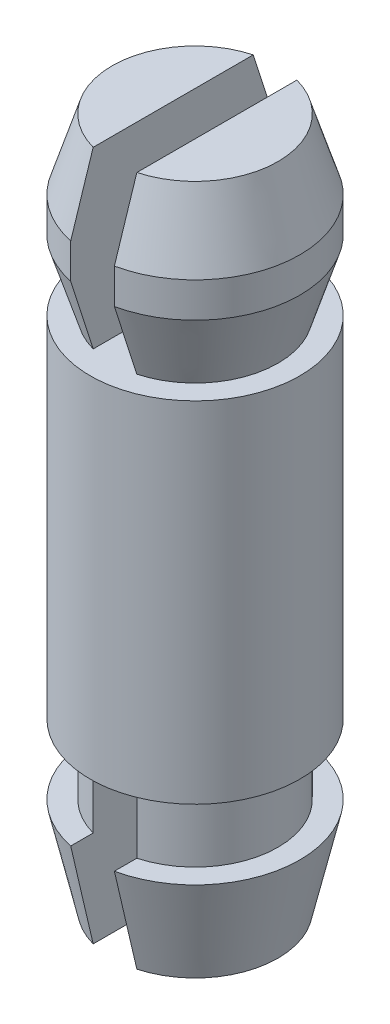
ISO-10303-21;
HEADER;
FILE_DESCRIPTION(('STEP AP214'),'2;1');
FILE_NAME('part.step','',(''),(''),'','','');
FILE_SCHEMA(('AUTOMOTIVE_DESIGN { 1 0 10303 214 1 1 1 1 }'));
ENDSEC;
DATA;
#1=APPLICATION_CONTEXT('core data for automotive mechanical design processes');
#2=APPLICATION_PROTOCOL_DEFINITION('international standard','automotive_design',2000,#1);
#3=PRODUCT_CONTEXT('',#1,'mechanical');
#4=PRODUCT('Part','Part','',(#3));
#5=PRODUCT_RELATED_PRODUCT_CATEGORY('part','',(#4));
#6=PRODUCT_DEFINITION_FORMATION('','',#4);
#7=PRODUCT_DEFINITION_CONTEXT('part definition',#1,'design');
#8=PRODUCT_DEFINITION('design','',#6,#7);
#9=PRODUCT_DEFINITION_SHAPE('','',#8);
#10=(LENGTH_UNIT() NAMED_UNIT(*) SI_UNIT(.MILLI.,.METRE.));
#11=(NAMED_UNIT(*) PLANE_ANGLE_UNIT() SI_UNIT($,.RADIAN.));
#12=(NAMED_UNIT(*) SI_UNIT($,.STERADIAN.) SOLID_ANGLE_UNIT());
#13=UNCERTAINTY_MEASURE_WITH_UNIT(LENGTH_MEASURE(1.E-05),#10,'distance_accuracy_value','');
#14=(GEOMETRIC_REPRESENTATION_CONTEXT(3) GLOBAL_UNCERTAINTY_ASSIGNED_CONTEXT((#13)) GLOBAL_UNIT_ASSIGNED_CONTEXT((#10,
#11,#12)) REPRESENTATION_CONTEXT('',''));
#15=CARTESIAN_POINT('',(0.,0.,0.));
#16=DIRECTION('',(0.,0.,1.));
#17=DIRECTION('',(1.,0.,0.));
#18=AXIS2_PLACEMENT_3D('',#15,#16,#17);
#19=CARTESIAN_POINT('',(0.,-3.8,0.));
#20=DIRECTION('',(0.,-1.,0.));
#21=DIRECTION('',(0.,0.,-1.));
#22=AXIS2_PLACEMENT_3D('',#19,#20,#21);
#23=PLANE('',#22);
#24=DIRECTION('',(0.,0.,1.));
#25=VECTOR('',#24,1.);
#26=CARTESIAN_POINT('',(-0.499999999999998,-3.8,-2.4));
#27=LINE('',#26,#25);
#28=CARTESIAN_POINT('',(-0.499999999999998,-3.8,-1.83303027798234));
#29=VERTEX_POINT('',#28);
#30=CARTESIAN_POINT('',(-0.499999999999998,-3.8,1.83303027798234));
#31=VERTEX_POINT('',#30);
#32=EDGE_CURVE('E272',#29,#31,#27,.T.);
#33=ORIENTED_EDGE('',*,*,#32,.T.);
#34=CARTESIAN_POINT('',(0.,-3.8,0.));
#35=DIRECTION('',(0.,-1.,0.));
#36=DIRECTION('',(0.,0.,-1.));
#37=AXIS2_PLACEMENT_3D('',#34,#35,#36);
#38=CIRCLE('',#37,1.9);
#39=EDGE_CURVE('E185',#31,#29,#38,.T.);
#40=ORIENTED_EDGE('',*,*,#39,.T.);
#41=EDGE_LOOP('',(#33,#40));
#42=FACE_BOUND('',#41,.T.);
#43=ADVANCED_FACE('F33',(#42),#23,.T.);
#44=CARTESIAN_POINT('',(0.,-3.8,0.));
#45=DIRECTION('',(0.,1.,0.));
#46=DIRECTION('',(0.,0.,1.));
#47=AXIS2_PLACEMENT_3D('',#44,#45,#46);
#48=CONICAL_SURFACE('',#47,1.9,0.223476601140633);
#49=CARTESIAN_POINT('',(-0.499999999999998,-6.49752165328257,-1.18582496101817));
#50=CARTESIAN_POINT('',(-0.499999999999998,-6.3270478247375,-1.2278632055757));
#51=CARTESIAN_POINT('',(-0.499999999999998,-6.15650043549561,-1.26960134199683));
#52=CARTESIAN_POINT('',(-0.499999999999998,-5.81529012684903,-1.35260079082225));
#53=CARTESIAN_POINT('',(-0.499999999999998,-5.64462720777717,-1.39386210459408));
#54=CARTESIAN_POINT('',(-0.499999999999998,-5.13251332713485,-1.51711571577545));
#55=CARTESIAN_POINT('',(-0.499999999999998,-4.79093499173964,-1.59857823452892));
#56=CARTESIAN_POINT('',(-0.499999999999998,-4.06171036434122,-1.77149560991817));
#57=CARTESIAN_POINT('',(-0.499999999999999,-3.67403418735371,-1.86282413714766));
#58=CARTESIAN_POINT('',(-0.499999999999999,-2.75052311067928,-2.07947896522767));
#59=CARTESIAN_POINT('',(-0.499999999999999,-2.21461146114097,-2.20447780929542));
#60=CARTESIAN_POINT('',(-0.499999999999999,-1.14259889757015,-2.45366261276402));
#61=CARTESIAN_POINT('',(-0.499999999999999,-0.606497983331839,-2.57784857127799));
#62=CARTESIAN_POINT('',(-0.499999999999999,0.785594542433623,-2.8996102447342));
#63=CARTESIAN_POINT('',(-0.499999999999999,1.64167926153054,-3.09678298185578));
#64=CARTESIAN_POINT('',(-0.499999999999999,3.35401578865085,-3.49040239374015));
#65=CARTESIAN_POINT('',(-0.499999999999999,4.21026759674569,-3.68684906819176));
#66=CARTESIAN_POINT('',(-0.499999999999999,5.92286668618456,-4.07929135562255));
#67=CARTESIAN_POINT('',(-0.5,6.77921396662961,-4.27528697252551));
#68=CARTESIAN_POINT('',(-0.5,8.49197804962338,-4.66697064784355));
#69=CARTESIAN_POINT('',(-0.5,9.34839485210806,-4.86265870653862));
#70=CARTESIAN_POINT('',(-0.5,10.2048304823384,-5.05826405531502));
#71=B_SPLINE_CURVE_WITH_KNOTS('',3,(#49,#50,#51,#52,#53,#54,#55,#56,#57,#58,#59,#60,#61,#62,#63,
#64,#65,#66,#67,#68,#69,#70),.UNSPECIFIED.,.F.,.F.,(4,2,2,2,2,2,2,2,2,2,4),(0.,
0.526740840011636,1.0534801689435,2.10695187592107,3.30181638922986,4.95270406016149,
6.60359353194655,9.23908579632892,11.874579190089,14.5100495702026,17.1455175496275),.UNSPECIFIED.);
#72=CARTESIAN_POINT('',(-0.499999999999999,-1.6,-2.3473389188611));
#73=VERTEX_POINT('',#72);
#74=EDGE_CURVE('E322',#29,#73,#71,.T.);
#75=ORIENTED_EDGE('',*,*,#74,.F.);
#76=ORIENTED_EDGE('',*,*,#39,.F.);
#77=CARTESIAN_POINT('',(-0.499999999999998,-6.49752165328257,1.18582496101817));
#78=CARTESIAN_POINT('',(-0.499999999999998,-6.3270478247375,1.2278632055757));
#79=CARTESIAN_POINT('',(-0.499999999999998,-6.15650043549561,1.26960134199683));
#80=CARTESIAN_POINT('',(-0.499999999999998,-5.81529012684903,1.35260079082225));
#81=CARTESIAN_POINT('',(-0.499999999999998,-5.64462720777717,1.39386210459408));
#82=CARTESIAN_POINT('',(-0.499999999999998,-5.13251332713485,1.51711571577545));
#83=CARTESIAN_POINT('',(-0.499999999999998,-4.79093499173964,1.59857823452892));
#84=CARTESIAN_POINT('',(-0.499999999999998,-4.06171036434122,1.77149560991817));
#85=CARTESIAN_POINT('',(-0.499999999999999,-3.67403418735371,1.86282413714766));
#86=CARTESIAN_POINT('',(-0.499999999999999,-2.75052311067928,2.07947896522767));
#87=CARTESIAN_POINT('',(-0.499999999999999,-2.21461146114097,2.20447780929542));
#88=CARTESIAN_POINT('',(-0.499999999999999,-1.14259889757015,2.45366261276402));
#89=CARTESIAN_POINT('',(-0.499999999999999,-0.606497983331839,2.57784857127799));
#90=CARTESIAN_POINT('',(-0.499999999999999,0.785594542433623,2.8996102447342));
#91=CARTESIAN_POINT('',(-0.499999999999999,1.64167926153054,3.09678298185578));
#92=CARTESIAN_POINT('',(-0.499999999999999,3.35401578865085,3.49040239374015));
#93=CARTESIAN_POINT('',(-0.499999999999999,4.21026759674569,3.68684906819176));
#94=CARTESIAN_POINT('',(-0.499999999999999,5.92286668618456,4.07929135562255));
#95=CARTESIAN_POINT('',(-0.5,6.77921396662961,4.27528697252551));
#96=CARTESIAN_POINT('',(-0.5,8.49197804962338,4.66697064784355));
#97=CARTESIAN_POINT('',(-0.5,9.34839485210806,4.86265870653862));
#98=CARTESIAN_POINT('',(-0.5,10.2048304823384,5.05826405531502));
#99=B_SPLINE_CURVE_WITH_KNOTS('',3,(#77,#78,#79,#80,#81,#82,#83,#84,#85,#86,#87,#88,#89,#90,#91,
#92,#93,#94,#95,#96,#97,#98),.UNSPECIFIED.,.F.,.F.,(4,2,2,2,2,2,2,2,2,2,4),(0.,
0.526740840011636,1.0534801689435,2.10695187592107,3.30181638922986,4.95270406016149,
6.60359353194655,9.23908579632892,11.874579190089,14.5100495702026,17.1455175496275),.UNSPECIFIED.);
#100=CARTESIAN_POINT('',(-0.499999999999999,-1.6,2.3473389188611));
#101=VERTEX_POINT('',#100);
#102=EDGE_CURVE('E155',#101,#31,#99,.F.);
#103=ORIENTED_EDGE('',*,*,#102,.F.);
#104=CARTESIAN_POINT('',(0.,-1.6,0.));
#105=DIRECTION('',(0.,-1.,0.));
#106=DIRECTION('',(0.,0.,-1.));
#107=AXIS2_PLACEMENT_3D('',#104,#105,#106);
#108=CIRCLE('',#107,2.4);
#109=EDGE_CURVE('E179',#101,#73,#108,.T.);
#110=ORIENTED_EDGE('',*,*,#109,.T.);
#111=EDGE_LOOP('',(#75,#76,#103,#110));
#112=FACE_BOUND('',#111,.T.);
#113=ADVANCED_FACE('F247',(#112),#48,.T.);
#114=CARTESIAN_POINT('',(2.4,-1.6,0.));
#115=DIRECTION('',(0.,1.,0.));
#116=DIRECTION('',(0.,0.,1.));
#117=AXIS2_PLACEMENT_3D('',#114,#115,#116);
#118=PLANE('',#117);
#119=DIRECTION('',(0.,0.,1.));
#120=VECTOR('',#119,1.);
#121=CARTESIAN_POINT('',(-0.499999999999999,-1.6,0.));
#122=LINE('',#121,#120);
#123=CARTESIAN_POINT('',(-0.499999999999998,-1.6,-1.83303027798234));
#124=VERTEX_POINT('',#123);
#125=EDGE_CURVE('E150',#73,#124,#122,.T.);
#126=ORIENTED_EDGE('',*,*,#125,.F.);
#127=ORIENTED_EDGE('',*,*,#109,.F.);
#128=CARTESIAN_POINT('',(-0.499999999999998,-1.6,1.83303027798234));
#129=VERTEX_POINT('',#128);
#130=EDGE_CURVE('E282',#129,#101,#122,.T.);
#131=ORIENTED_EDGE('',*,*,#130,.F.);
#132=CARTESIAN_POINT('',(0.,-1.6,0.));
#133=DIRECTION('',(0.,-1.,0.));
#134=DIRECTION('',(0.,0.,-1.));
#135=AXIS2_PLACEMENT_3D('',#132,#133,#134);
#136=CIRCLE('',#135,1.9);
#137=EDGE_CURVE('E170',#129,#124,#136,.T.);
#138=ORIENTED_EDGE('',*,*,#137,.T.);
#139=EDGE_LOOP('',(#126,#127,#131,#138));
#140=FACE_BOUND('',#139,.T.);
#141=ADVANCED_FACE('F252',(#140),#118,.T.);
#142=CARTESIAN_POINT('',(0.,-3.8,0.));
#143=DIRECTION('',(0.,-1.,0.));
#144=DIRECTION('',(0.,0.,-1.));
#145=AXIS2_PLACEMENT_3D('',#142,#143,#144);
#146=CYLINDRICAL_SURFACE('',#145,1.9);
#147=DIRECTION('',(0.,-1.,0.));
#148=VECTOR('',#147,1.);
#149=CARTESIAN_POINT('',(-0.499999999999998,-3.8,-1.83303027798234));
#150=LINE('',#149,#148);
#151=CARTESIAN_POINT('',(-0.499999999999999,0.,-1.83303027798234));
#152=VERTEX_POINT('',#151);
#153=EDGE_CURVE('E144',#124,#152,#150,.F.);
#154=ORIENTED_EDGE('',*,*,#153,.F.);
#155=ORIENTED_EDGE('',*,*,#137,.F.);
#156=DIRECTION('',(0.,-1.,0.));
#157=VECTOR('',#156,1.);
#158=CARTESIAN_POINT('',(-0.499999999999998,-3.8,1.83303027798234));
#159=LINE('',#158,#157);
#160=CARTESIAN_POINT('',(-0.499999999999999,0.,1.83303027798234));
#161=VERTEX_POINT('',#160);
#162=EDGE_CURVE('E165',#161,#129,#159,.T.);
#163=ORIENTED_EDGE('',*,*,#162,.F.);
#164=CARTESIAN_POINT('',(0.,0.,0.));
#165=DIRECTION('',(0.,-1.,0.));
#166=DIRECTION('',(0.,0.,-1.));
#167=AXIS2_PLACEMENT_3D('',#164,#165,#166);
#168=CIRCLE('',#167,1.9);
#169=EDGE_CURVE('E161',#161,#152,#168,.T.);
#170=ORIENTED_EDGE('',*,*,#169,.T.);
#171=EDGE_LOOP('',(#154,#155,#163,#170));
#172=FACE_BOUND('',#171,.T.);
#173=ADVANCED_FACE('F164',(#172),#146,.T.);
#174=CARTESIAN_POINT('',(0.,8.,0.));
#175=DIRECTION('',(0.,1.,0.));
#176=DIRECTION('',(0.,0.,1.));
#177=AXIS2_PLACEMENT_3D('',#174,#175,#176);
#178=CONICAL_SURFACE('',#177,1.9,0.302884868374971);
#179=CARTESIAN_POINT('',(-0.499999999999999,5.41360855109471,-0.970527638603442));
#180=CARTESIAN_POINT('',(-0.5,5.54585791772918,-1.01698560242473));
#181=CARTESIAN_POINT('',(-0.5,5.67830320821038,-1.06287926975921));
#182=CARTESIAN_POINT('',(-0.5,5.94348659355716,-1.15380666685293));
#183=CARTESIAN_POINT('',(-0.5,6.07622468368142,-1.19884041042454));
#184=CARTESIAN_POINT('',(-0.5,6.34189411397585,-1.28831648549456));
#185=CARTESIAN_POINT('',(-0.5,6.47482544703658,-1.33275883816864));
#186=CARTESIAN_POINT('',(-0.5,6.74083665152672,-1.42119853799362));
#187=CARTESIAN_POINT('',(-0.5,6.87391652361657,-1.4651958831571));
#188=CARTESIAN_POINT('',(-0.5,7.23102104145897,-1.58275854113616));
#189=CARTESIAN_POINT('',(-0.5,7.45514673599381,-1.65601670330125));
#190=CARTESIAN_POINT('',(-0.5,7.90360722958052,-1.80190125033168));
#191=CARTESIAN_POINT('',(-0.5,8.12794203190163,-1.87452762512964));
#192=CARTESIAN_POINT('',(-0.5,8.59793854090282,-2.02616777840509));
#193=CARTESIAN_POINT('',(-0.5,8.8436144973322,-2.10513736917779));
#194=CARTESIAN_POINT('',(-0.5,9.33508844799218,-2.26269607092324));
#195=CARTESIAN_POINT('',(-0.5,9.58088644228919,-2.3412851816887));
#196=CARTESIAN_POINT('',(-0.5,10.0725608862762,-2.49817982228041));
#197=CARTESIAN_POINT('',(-0.5,10.3184373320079,-2.57648536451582));
#198=CARTESIAN_POINT('',(-0.5,10.8102587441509,-2.7328796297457));
#199=CARTESIAN_POINT('',(-0.5,11.0562037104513,-2.81096835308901));
#200=CARTESIAN_POINT('',(-0.5,11.3021729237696,-2.88898042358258));
#201=B_SPLINE_CURVE_WITH_KNOTS('',3,(#179,#180,#181,#182,#183,#184,#185,#186,#187,#188,#189,
#190,#191,#192,#193,#194,#195,#196,#197,#198,#199,#200),.UNSPECIFIED.,.F.,.F.,(4,2,2,2,2,2,2,2,
2,2,4),(0.,0.420512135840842,0.841017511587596,1.26150778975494,1.68199994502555,
2.38938211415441,3.09677553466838,3.87094291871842,4.64511072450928,5.41924423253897,
6.19337649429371),.UNSPECIFIED.);
#202=CARTESIAN_POINT('',(-0.5,8.,-1.83303027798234));
#203=VERTEX_POINT('',#202);
#204=CARTESIAN_POINT('',(-0.499999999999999,9.6,-2.3473389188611));
#205=VERTEX_POINT('',#204);
#206=EDGE_CURVE('E209',#203,#205,#201,.T.);
#207=ORIENTED_EDGE('',*,*,#206,.F.);
#208=CARTESIAN_POINT('',(0.,8.,0.));
#209=DIRECTION('',(0.,-1.,0.));
#210=DIRECTION('',(0.,0.,-1.));
#211=AXIS2_PLACEMENT_3D('',#208,#209,#210);
#212=CIRCLE('',#211,1.9);
#213=CARTESIAN_POINT('',(-0.5,8.,1.83303027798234));
#214=VERTEX_POINT('',#213);
#215=EDGE_CURVE('E224',#214,#203,#212,.T.);
#216=ORIENTED_EDGE('',*,*,#215,.F.);
#217=CARTESIAN_POINT('',(-0.5,11.3021729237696,2.88898042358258));
#218=CARTESIAN_POINT('',(-0.5,10.8102265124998,2.73291329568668));
#219=CARTESIAN_POINT('',(-0.5,10.3183553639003,2.57660611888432));
#220=CARTESIAN_POINT('',(-0.5,9.58083707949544,2.34127312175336));
#221=CARTESIAN_POINT('',(-0.5,9.33505020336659,2.26268485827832));
#222=CARTESIAN_POINT('',(-0.5,8.84359639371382,2.10513051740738));
#223=CARTESIAN_POINT('',(-0.5,8.5979294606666,2.02616443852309));
#224=CARTESIAN_POINT('',(-0.5,8.10675653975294,1.86769272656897));
#225=CARTESIAN_POINT('',(-0.5,7.86125056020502,1.78818706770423));
#226=CARTESIAN_POINT('',(-0.5,7.37049472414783,1.62839503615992));
#227=CARTESIAN_POINT('',(-0.5,7.12524486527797,1.54810867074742));
#228=CARTESIAN_POINT('',(-0.5,6.75766981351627,1.42675226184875));
#229=CARTESIAN_POINT('',(-0.5,6.6351920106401,1.38614472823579));
#230=CARTESIAN_POINT('',(-0.5,6.39037170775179,1.30452529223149));
#231=CARTESIAN_POINT('',(-0.5,6.26802920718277,1.26351339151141));
#232=CARTESIAN_POINT('',(-0.5,6.02351794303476,1.1809607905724));
#233=CARTESIAN_POINT('',(-0.5,5.90134918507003,1.13942007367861));
#234=CARTESIAN_POINT('',(-0.5,5.65726702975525,1.05559016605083));
#235=CARTESIAN_POINT('',(-0.5,5.53535363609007,1.01330096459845));
#236=CARTESIAN_POINT('',(-0.499999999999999,5.41360855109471,0.970527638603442));
#237=B_SPLINE_CURVE_WITH_KNOTS('',3,(#217,#218,#219,#220,#221,#222,#223,#224,#225,#226,#227,
#228,#229,#230,#231,#232,#233,#234,#235,#236),.UNSPECIFIED.,.F.,.F.,(4,2,2,2,2,2,2,2,2,4),(0.,
1.54832710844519,2.32246243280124,3.09660080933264,3.87077645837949,4.64494490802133,
5.03204648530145,5.41914646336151,5.80625867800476,6.19337644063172),.UNSPECIFIED.);
#238=CARTESIAN_POINT('',(-0.499999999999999,9.6,2.3473389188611));
#239=VERTEX_POINT('',#238);
#240=EDGE_CURVE('E373',#239,#214,#237,.T.);
#241=ORIENTED_EDGE('',*,*,#240,.F.);
#242=CARTESIAN_POINT('',(0.,9.6,0.));
#243=DIRECTION('',(0.,-1.,0.));
#244=DIRECTION('',(0.,0.,-1.));
#245=AXIS2_PLACEMENT_3D('',#242,#243,#244);
#246=CIRCLE('',#245,2.4);
#247=EDGE_CURVE('E218',#239,#205,#246,.T.);
#248=ORIENTED_EDGE('',*,*,#247,.T.);
#249=EDGE_LOOP('',(#207,#216,#241,#248));
#250=FACE_BOUND('',#249,.T.);
#251=ADVANCED_FACE('F242',(#250),#178,.T.);
#252=CARTESIAN_POINT('',(0.,-3.8,0.));
#253=DIRECTION('',(0.,-1.,0.));
#254=DIRECTION('',(0.,0.,-1.));
#255=AXIS2_PLACEMENT_3D('',#252,#253,#254);
#256=CYLINDRICAL_SURFACE('',#255,2.4);
#257=DIRECTION('',(0.,-1.,0.));
#258=VECTOR('',#257,1.);
#259=CARTESIAN_POINT('',(0.499999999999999,-3.8,2.3473389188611));
#260=LINE('',#259,#258);
#261=CARTESIAN_POINT('',(0.499999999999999,9.6,2.3473389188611));
#262=VERTEX_POINT('',#261);
#263=CARTESIAN_POINT('',(0.5,10.4,2.3473389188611));
#264=VERTEX_POINT('',#263);
#265=EDGE_CURVE('E339',#262,#264,#260,.F.);
#266=ORIENTED_EDGE('',*,*,#265,.F.);
#267=CARTESIAN_POINT('',(0.499999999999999,9.6,-2.3473389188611));
#268=VERTEX_POINT('',#267);
#269=EDGE_CURVE('E221',#268,#262,#246,.T.);
#270=ORIENTED_EDGE('',*,*,#269,.F.);
#271=DIRECTION('',(0.,-1.,0.));
#272=VECTOR('',#271,1.);
#273=CARTESIAN_POINT('',(0.499999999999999,-3.8,-2.3473389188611));
#274=LINE('',#273,#272);
#275=CARTESIAN_POINT('',(0.5,10.4,-2.3473389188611));
#276=VERTEX_POINT('',#275);
#277=EDGE_CURVE('E199',#276,#268,#274,.T.);
#278=ORIENTED_EDGE('',*,*,#277,.F.);
#279=CARTESIAN_POINT('',(0.,10.4,0.));
#280=DIRECTION('',(0.,-1.,0.));
#281=DIRECTION('',(0.,0.,-1.));
#282=AXIS2_PLACEMENT_3D('',#279,#280,#281);
#283=CIRCLE('',#282,2.4);
#284=EDGE_CURVE('E198',#276,#264,#283,.T.);
#285=ORIENTED_EDGE('',*,*,#284,.T.);
#286=EDGE_LOOP('',(#266,#270,#278,#285));
#287=FACE_BOUND('',#286,.T.);
#288=ADVANCED_FACE('F402',(#287),#256,.T.);
#289=CARTESIAN_POINT('',(0.,10.4,0.));
#290=DIRECTION('',(0.,-1.,0.));
#291=DIRECTION('',(0.,0.,-1.));
#292=AXIS2_PLACEMENT_3D('',#289,#290,#291);
#293=CONICAL_SURFACE('',#292,2.4,0.302884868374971);
#294=CARTESIAN_POINT('',(-0.5,7.6398215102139,-3.22401460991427));
#295=CARTESIAN_POINT('',(-0.5,8.18731851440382,-3.05083408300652));
#296=CARTESIAN_POINT('',(-0.5,8.73474800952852,-2.87743814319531));
#297=CARTESIAN_POINT('',(-0.5,9.55563881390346,-2.61656864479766));
#298=CARTESIAN_POINT('',(-0.5,9.82922375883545,-2.52948386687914));
#299=CARTESIAN_POINT('',(-0.5,10.3762875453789,-2.35497919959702));
#300=CARTESIAN_POINT('',(-0.5,10.6497663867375,-2.26755930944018));
#301=CARTESIAN_POINT('',(-0.5,11.1965802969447,-2.09224321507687));
#302=CARTESIAN_POINT('',(-0.5,11.46991536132,-2.00434699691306));
#303=CARTESIAN_POINT('',(-0.5,12.0163621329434,-1.82786691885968));
#304=CARTESIAN_POINT('',(-0.5,12.2894738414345,-1.73928306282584));
#305=CARTESIAN_POINT('',(-0.5,12.6988811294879,-1.60559713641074));
#306=CARTESIAN_POINT('',(-0.5,12.8353087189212,-1.56089951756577));
#307=CARTESIAN_POINT('',(-0.5,13.1080478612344,-1.47115261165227));
#308=CARTESIAN_POINT('',(-0.5,13.2443594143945,-1.42610332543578));
#309=CARTESIAN_POINT('',(-0.5,13.5168337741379,-1.33554758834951));
#310=CARTESIAN_POINT('',(-0.5,13.6529965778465,-1.29004112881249));
#311=CARTESIAN_POINT('',(-0.5,13.9251076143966,-1.19838786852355));
#312=CARTESIAN_POINT('',(-0.5,14.061055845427,-1.15224106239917));
#313=CARTESIAN_POINT('',(-0.5,14.1968640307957,-1.10568245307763));
#314=B_SPLINE_CURVE_WITH_KNOTS('',3,(#294,#295,#296,#297,#298,#299,#300,#301,#302,#303,#304,
#305,#306,#307,#308,#309,#310,#311,#312,#313),.UNSPECIFIED.,.F.,.F.,(4,2,2,2,2,2,2,2,2,4),(0.,
1.72270206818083,2.58403367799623,3.44536732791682,4.30672635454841,5.16808055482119,
5.59876948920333,6.02945738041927,6.46015345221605,6.8908531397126),.UNSPECIFIED.);
#315=CARTESIAN_POINT('',(-0.5,10.4,-2.3473389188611));
#316=VERTEX_POINT('',#315);
#317=CARTESIAN_POINT('',(-0.5,12.,-1.83303027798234));
#318=VERTEX_POINT('',#317);
#319=EDGE_CURVE('E378',#316,#318,#314,.T.);
#320=ORIENTED_EDGE('',*,*,#319,.F.);
#321=CARTESIAN_POINT('',(-0.5,10.4,2.3473389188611));
#322=VERTEX_POINT('',#321);
#323=EDGE_CURVE('E203',#322,#316,#283,.T.);
#324=ORIENTED_EDGE('',*,*,#323,.F.);
#325=CARTESIAN_POINT('',(-0.5,14.1968640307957,1.10568245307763));
#326=CARTESIAN_POINT('',(-0.500000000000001,14.0494896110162,1.15620163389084));
#327=CARTESIAN_POINT('',(-0.5,13.9019523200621,1.20624141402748));
#328=CARTESIAN_POINT('',(-0.5,13.6066318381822,1.3055860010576));
#329=CARTESIAN_POINT('',(-0.5,13.4588486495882,1.35489081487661));
#330=CARTESIAN_POINT('',(-0.5,13.1631166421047,1.45298917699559));
#331=CARTESIAN_POINT('',(-0.5,13.0151678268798,1.50178273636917));
#332=CARTESIAN_POINT('',(-0.5,12.719142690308,1.59898268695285));
#333=CARTESIAN_POINT('',(-0.5,12.571066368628,1.64738907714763));
#334=CARTESIAN_POINT('',(-0.5,12.1731952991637,1.77701784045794));
#335=CARTESIAN_POINT('',(-0.5,11.9233125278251,1.85796990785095));
#336=CARTESIAN_POINT('',(-0.5,11.4233636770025,2.01931352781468));
#337=CARTESIAN_POINT('',(-0.5,11.1732975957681,2.09970507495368));
#338=CARTESIAN_POINT('',(-0.5,10.3763527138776,2.35522584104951));
#339=CARTESIAN_POINT('',(-0.5,9.8292388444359,2.5296216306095));
#340=CARTESIAN_POINT('',(-0.5,9.00834677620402,2.79049171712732));
#341=CARTESIAN_POINT('',(-0.5,8.7346828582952,2.87732666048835));
#342=CARTESIAN_POINT('',(-0.5,8.18729415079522,3.0508035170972));
#343=CARTESIAN_POINT('',(-0.5,7.9135693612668,3.13744543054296));
#344=CARTESIAN_POINT('',(-0.5,7.6398215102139,3.22401460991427));
#345=B_SPLINE_CURVE_WITH_KNOTS('',3,(#325,#326,#327,#328,#329,#330,#331,#332,#333,#334,#335,
#336,#337,#338,#339,#340,#341,#342,#343,#344),.UNSPECIFIED.,.F.,.F.,(4,2,2,2,2,2,2,2,2,4),(0.,
0.467375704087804,0.93474700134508,1.40210815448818,1.86947053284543,2.65747433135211,
3.4454857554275,5.16819270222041,6.02952321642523,6.89085284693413),.UNSPECIFIED.);
#346=CARTESIAN_POINT('',(-0.5,12.,1.83303027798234));
#347=VERTEX_POINT('',#346);
#348=EDGE_CURVE('E363',#347,#322,#345,.T.);
#349=ORIENTED_EDGE('',*,*,#348,.F.);
#350=CARTESIAN_POINT('',(0.,12.,0.));
#351=DIRECTION('',(0.,-1.,0.));
#352=DIRECTION('',(0.,0.,-1.));
#353=AXIS2_PLACEMENT_3D('',#350,#351,#352);
#354=CIRCLE('',#353,1.9);
#355=EDGE_CURVE('E204',#347,#318,#354,.T.);
#356=ORIENTED_EDGE('',*,*,#355,.T.);
#357=EDGE_LOOP('',(#320,#324,#349,#356));
#358=FACE_BOUND('',#357,.T.);
#359=ADVANCED_FACE('F265',(#358),#293,.T.);
#360=CARTESIAN_POINT('',(1.9,12.,0.));
#361=DIRECTION('',(0.,1.,0.));
#362=DIRECTION('',(0.,0.,1.));
#363=AXIS2_PLACEMENT_3D('',#360,#361,#362);
#364=PLANE('',#363);
#365=DIRECTION('',(0.,0.,1.));
#366=VECTOR('',#365,1.);
#367=CARTESIAN_POINT('',(-0.5,12.,0.));
#368=LINE('',#367,#366);
#369=EDGE_CURVE('E11',#318,#347,#368,.T.);
#370=ORIENTED_EDGE('',*,*,#369,.F.);
#371=ORIENTED_EDGE('',*,*,#355,.F.);
#372=EDGE_LOOP('',(#370,#371));
#373=FACE_BOUND('',#372,.T.);
#374=ADVANCED_FACE('F257',(#373),#364,.T.);
#375=DIRECTION('',(0.,0.,1.));
#376=VECTOR('',#375,1.);
#377=CARTESIAN_POINT('',(0.499999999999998,-3.8,-2.4));
#378=LINE('',#377,#376);
#379=CARTESIAN_POINT('',(0.499999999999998,-3.8,-1.83303027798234));
#380=VERTEX_POINT('',#379);
#381=CARTESIAN_POINT('',(0.499999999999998,-3.8,1.83303027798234));
#382=VERTEX_POINT('',#381);
#383=EDGE_CURVE('E269',#380,#382,#378,.T.);
#384=ORIENTED_EDGE('',*,*,#383,.F.);
#385=EDGE_CURVE('E183',#380,#382,#38,.T.);
#386=ORIENTED_EDGE('',*,*,#385,.T.);
#387=EDGE_LOOP('',(#384,#386));
#388=FACE_BOUND('',#387,.T.);
#389=ADVANCED_FACE('F35',(#388),#23,.T.);
#390=CARTESIAN_POINT('',(0.499999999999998,-6.49752165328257,-1.18582496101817));
#391=CARTESIAN_POINT('',(0.499999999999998,-6.3270478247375,-1.2278632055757));
#392=CARTESIAN_POINT('',(0.499999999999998,-6.15650043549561,-1.26960134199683));
#393=CARTESIAN_POINT('',(0.499999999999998,-5.81529012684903,-1.35260079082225));
#394=CARTESIAN_POINT('',(0.499999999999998,-5.64462720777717,-1.39386210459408));
#395=CARTESIAN_POINT('',(0.499999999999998,-5.13251332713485,-1.51711571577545));
#396=CARTESIAN_POINT('',(0.499999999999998,-4.79093499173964,-1.59857823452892));
#397=CARTESIAN_POINT('',(0.499999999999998,-4.06171036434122,-1.77149560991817));
#398=CARTESIAN_POINT('',(0.499999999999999,-3.67403418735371,-1.86282413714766));
#399=CARTESIAN_POINT('',(0.499999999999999,-2.75052311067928,-2.07947896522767));
#400=CARTESIAN_POINT('',(0.499999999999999,-2.21461146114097,-2.20447780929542));
#401=CARTESIAN_POINT('',(0.499999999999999,-1.14259889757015,-2.45366261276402));
#402=CARTESIAN_POINT('',(0.499999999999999,-0.606497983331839,-2.57784857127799));
#403=CARTESIAN_POINT('',(0.499999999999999,0.785594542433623,-2.8996102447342));
#404=CARTESIAN_POINT('',(0.499999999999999,1.64167926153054,-3.09678298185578));
#405=CARTESIAN_POINT('',(0.499999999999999,3.35401578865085,-3.49040239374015));
#406=CARTESIAN_POINT('',(0.499999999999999,4.21026759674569,-3.68684906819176));
#407=CARTESIAN_POINT('',(0.499999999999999,5.92286668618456,-4.07929135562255));
#408=CARTESIAN_POINT('',(0.5,6.77921396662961,-4.27528697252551));
#409=CARTESIAN_POINT('',(0.5,8.49197804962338,-4.66697064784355));
#410=CARTESIAN_POINT('',(0.5,9.34839485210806,-4.86265870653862));
#411=CARTESIAN_POINT('',(0.5,10.2048304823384,-5.05826405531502));
#412=B_SPLINE_CURVE_WITH_KNOTS('',3,(#390,#391,#392,#393,#394,#395,#396,#397,#398,#399,#400,
#401,#402,#403,#404,#405,#406,#407,#408,#409,#410,#411),.UNSPECIFIED.,.F.,.F.,(4,2,2,2,2,2,2,2,
2,2,4),(0.,0.526740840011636,1.0534801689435,2.10695187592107,3.30181638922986,4.95270406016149,
6.60359353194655,9.23908579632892,11.874579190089,14.5100495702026,17.1455175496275),.UNSPECIFIED.);
#413=CARTESIAN_POINT('',(0.499999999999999,-1.6,-2.3473389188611));
#414=VERTEX_POINT('',#413);
#415=EDGE_CURVE('E276',#414,#380,#412,.F.);
#416=ORIENTED_EDGE('',*,*,#415,.F.);
#417=CARTESIAN_POINT('',(0.499999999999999,-1.6,2.3473389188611));
#418=VERTEX_POINT('',#417);
#419=EDGE_CURVE('E182',#414,#418,#108,.T.);
#420=ORIENTED_EDGE('',*,*,#419,.T.);
#421=CARTESIAN_POINT('',(0.499999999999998,-6.49752165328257,1.18582496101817));
#422=CARTESIAN_POINT('',(0.499999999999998,-6.3270478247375,1.2278632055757));
#423=CARTESIAN_POINT('',(0.499999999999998,-6.15650043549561,1.26960134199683));
#424=CARTESIAN_POINT('',(0.499999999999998,-5.81529012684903,1.35260079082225));
#425=CARTESIAN_POINT('',(0.499999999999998,-5.64462720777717,1.39386210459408));
#426=CARTESIAN_POINT('',(0.499999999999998,-5.13251332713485,1.51711571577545));
#427=CARTESIAN_POINT('',(0.499999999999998,-4.79093499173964,1.59857823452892));
#428=CARTESIAN_POINT('',(0.499999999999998,-4.06171036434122,1.77149560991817));
#429=CARTESIAN_POINT('',(0.499999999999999,-3.67403418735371,1.86282413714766));
#430=CARTESIAN_POINT('',(0.499999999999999,-2.75052311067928,2.07947896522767));
#431=CARTESIAN_POINT('',(0.499999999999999,-2.21461146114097,2.20447780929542));
#432=CARTESIAN_POINT('',(0.499999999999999,-1.14259889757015,2.45366261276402));
#433=CARTESIAN_POINT('',(0.499999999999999,-0.606497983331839,2.57784857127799));
#434=CARTESIAN_POINT('',(0.499999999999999,0.785594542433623,2.8996102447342));
#435=CARTESIAN_POINT('',(0.499999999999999,1.64167926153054,3.09678298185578));
#436=CARTESIAN_POINT('',(0.499999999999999,3.35401578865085,3.49040239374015));
#437=CARTESIAN_POINT('',(0.499999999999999,4.21026759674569,3.68684906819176));
#438=CARTESIAN_POINT('',(0.499999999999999,5.92286668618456,4.07929135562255));
#439=CARTESIAN_POINT('',(0.5,6.77921396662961,4.27528697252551));
#440=CARTESIAN_POINT('',(0.5,8.49197804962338,4.66697064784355));
#441=CARTESIAN_POINT('',(0.5,9.34839485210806,4.86265870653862));
#442=CARTESIAN_POINT('',(0.5,10.2048304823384,5.05826405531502));
#443=B_SPLINE_CURVE_WITH_KNOTS('',3,(#421,#422,#423,#424,#425,#426,#427,#428,#429,#430,#431,
#432,#433,#434,#435,#436,#437,#438,#439,#440,#441,#442),.UNSPECIFIED.,.F.,.F.,(4,2,2,2,2,2,2,2,
2,2,4),(0.,0.526740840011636,1.0534801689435,2.10695187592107,3.30181638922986,4.95270406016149,
6.60359353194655,9.23908579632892,11.874579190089,14.5100495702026,17.1455175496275),.UNSPECIFIED.);
#444=EDGE_CURVE('E278',#382,#418,#443,.T.);
#445=ORIENTED_EDGE('',*,*,#444,.F.);
#446=ORIENTED_EDGE('',*,*,#385,.F.);
#447=EDGE_LOOP('',(#416,#420,#445,#446));
#448=FACE_BOUND('',#447,.T.);
#449=ADVANCED_FACE('F254',(#448),#48,.T.);
#450=DIRECTION('',(0.,0.,-1.));
#451=VECTOR('',#450,1.);
#452=CARTESIAN_POINT('',(0.499999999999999,-1.6,0.));
#453=LINE('',#452,#451);
#454=CARTESIAN_POINT('',(0.499999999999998,-1.6,1.83303027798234));
#455=VERTEX_POINT('',#454);
#456=EDGE_CURVE('E280',#418,#455,#453,.T.);
#457=ORIENTED_EDGE('',*,*,#456,.F.);
#458=ORIENTED_EDGE('',*,*,#419,.F.);
#459=CARTESIAN_POINT('',(0.499999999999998,-1.6,-1.83303027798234));
#460=VERTEX_POINT('',#459);
#461=EDGE_CURVE('E286',#460,#414,#453,.T.);
#462=ORIENTED_EDGE('',*,*,#461,.F.);
#463=EDGE_CURVE('E176',#460,#455,#136,.T.);
#464=ORIENTED_EDGE('',*,*,#463,.T.);
#465=EDGE_LOOP('',(#457,#458,#462,#464));
#466=FACE_BOUND('',#465,.T.);
#467=ADVANCED_FACE('F263',(#466),#118,.T.);
#468=DIRECTION('',(0.,-1.,0.));
#469=VECTOR('',#468,1.);
#470=CARTESIAN_POINT('',(0.499999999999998,-3.8,1.83303027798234));
#471=LINE('',#470,#469);
#472=CARTESIAN_POINT('',(0.499999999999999,0.,1.83303027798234));
#473=VERTEX_POINT('',#472);
#474=EDGE_CURVE('E284',#455,#473,#471,.F.);
#475=ORIENTED_EDGE('',*,*,#474,.F.);
#476=ORIENTED_EDGE('',*,*,#463,.F.);
#477=DIRECTION('',(0.,-1.,0.));
#478=VECTOR('',#477,1.);
#479=CARTESIAN_POINT('',(0.499999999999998,-3.8,-1.83303027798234));
#480=LINE('',#479,#478);
#481=CARTESIAN_POINT('',(0.499999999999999,0.,-1.83303027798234));
#482=VERTEX_POINT('',#481);
#483=EDGE_CURVE('E162',#482,#460,#480,.T.);
#484=ORIENTED_EDGE('',*,*,#483,.F.);
#485=EDGE_CURVE('E166',#482,#473,#168,.T.);
#486=ORIENTED_EDGE('',*,*,#485,.T.);
#487=EDGE_LOOP('',(#475,#476,#484,#486));
#488=FACE_BOUND('',#487,.T.);
#489=ADVANCED_FACE('F313',(#488),#146,.T.);
#490=CARTESIAN_POINT('',(1.9,0.,0.));
#491=DIRECTION('',(0.,-1.,0.));
#492=DIRECTION('',(0.,0.,-1.));
#493=AXIS2_PLACEMENT_3D('',#490,#491,#492);
#494=PLANE('',#493);
#495=ORIENTED_EDGE('',*,*,#485,.F.);
#496=DIRECTION('',(0.,0.,1.));
#497=VECTOR('',#496,1.);
#498=CARTESIAN_POINT('',(0.499999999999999,0.,-2.4));
#499=LINE('',#498,#497);
#500=EDGE_CURVE('E48',#482,#473,#499,.T.);
#501=ORIENTED_EDGE('',*,*,#500,.T.);
#502=EDGE_LOOP('',(#495,#501));
#503=FACE_BOUND('',#502,.T.);
#504=ORIENTED_EDGE('',*,*,#169,.F.);
#505=DIRECTION('',(0.,0.,1.));
#506=VECTOR('',#505,1.);
#507=CARTESIAN_POINT('',(-0.499999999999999,0.,-2.4));
#508=LINE('',#507,#506);
#509=EDGE_CURVE('E147',#152,#161,#508,.T.);
#510=ORIENTED_EDGE('',*,*,#509,.F.);
#511=EDGE_LOOP('',(#504,#510));
#512=FACE_BOUND('',#511,.T.);
#513=CARTESIAN_POINT('',(0.,0.,0.));
#514=DIRECTION('',(0.,-1.,0.));
#515=DIRECTION('',(0.,0.,-1.));
#516=AXIS2_PLACEMENT_3D('',#513,#514,#515);
#517=CIRCLE('',#516,2.4);
#518=CARTESIAN_POINT('',(0.,0.,-2.4));
#519=VERTEX_POINT('',#518);
#520=EDGE_CURVE('E167',#519,#519,#517,.T.);
#521=ORIENTED_EDGE('',*,*,#520,.T.);
#522=EDGE_LOOP('',(#521));
#523=FACE_BOUND('',#522,.T.);
#524=ADVANCED_FACE('F159',(#503,#512,#523),#494,.T.);
#525=CARTESIAN_POINT('',(0.,-3.8,0.));
#526=DIRECTION('',(0.,-1.,0.));
#527=DIRECTION('',(0.,0.,-1.));
#528=AXIS2_PLACEMENT_3D('',#525,#526,#527);
#529=CYLINDRICAL_SURFACE('',#528,2.4);
#530=CARTESIAN_POINT('',(0.,8.,0.));
#531=DIRECTION('',(0.,-1.,0.));
#532=DIRECTION('',(0.,0.,-1.));
#533=AXIS2_PLACEMENT_3D('',#530,#531,#532);
#534=CIRCLE('',#533,2.4);
#535=CARTESIAN_POINT('',(0.,8.,-2.4));
#536=VERTEX_POINT('',#535);
#537=EDGE_CURVE('E172',#536,#536,#534,.T.);
#538=ORIENTED_EDGE('',*,*,#537,.T.);
#539=EDGE_LOOP('',(#538));
#540=FACE_BOUND('',#539,.T.);
#541=ORIENTED_EDGE('',*,*,#520,.F.);
#542=EDGE_LOOP('',(#541));
#543=FACE_BOUND('',#542,.T.);
#544=ADVANCED_FACE('F228',(#540,#543),#529,.T.);
#545=CARTESIAN_POINT('',(2.4,8.,0.));
#546=DIRECTION('',(0.,1.,0.));
#547=DIRECTION('',(0.,0.,1.));
#548=AXIS2_PLACEMENT_3D('',#545,#546,#547);
#549=PLANE('',#548);
#550=ORIENTED_EDGE('',*,*,#215,.T.);
#551=DIRECTION('',(0.,0.,1.));
#552=VECTOR('',#551,1.);
#553=CARTESIAN_POINT('',(-0.5,8.,-2.4));
#554=LINE('',#553,#552);
#555=EDGE_CURVE('E323',#203,#214,#554,.T.);
#556=ORIENTED_EDGE('',*,*,#555,.T.);
#557=EDGE_LOOP('',(#550,#556));
#558=FACE_BOUND('',#557,.T.);
#559=CARTESIAN_POINT('',(0.5,8.,-1.83303027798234));
#560=VERTEX_POINT('',#559);
#561=CARTESIAN_POINT('',(0.5,8.,1.83303027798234));
#562=VERTEX_POINT('',#561);
#563=EDGE_CURVE('E222',#560,#562,#212,.T.);
#564=ORIENTED_EDGE('',*,*,#563,.T.);
#565=DIRECTION('',(0.,0.,1.));
#566=VECTOR('',#565,1.);
#567=CARTESIAN_POINT('',(0.5,8.,-2.4));
#568=LINE('',#567,#566);
#569=EDGE_CURVE('E326',#560,#562,#568,.T.);
#570=ORIENTED_EDGE('',*,*,#569,.F.);
#571=EDGE_LOOP('',(#564,#570));
#572=FACE_BOUND('',#571,.T.);
#573=ORIENTED_EDGE('',*,*,#537,.F.);
#574=EDGE_LOOP('',(#573));
#575=FACE_BOUND('',#574,.T.);
#576=ADVANCED_FACE('F231',(#558,#572,#575),#549,.T.);
#577=CARTESIAN_POINT('',(0.5,11.3021729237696,-2.88898042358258));
#578=CARTESIAN_POINT('',(0.5,10.8102265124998,-2.73291329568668));
#579=CARTESIAN_POINT('',(0.5,10.3183553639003,-2.57660611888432));
#580=CARTESIAN_POINT('',(0.5,9.58083707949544,-2.34127312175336));
#581=CARTESIAN_POINT('',(0.5,9.33505020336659,-2.26268485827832));
#582=CARTESIAN_POINT('',(0.5,8.84359639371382,-2.10513051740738));
#583=CARTESIAN_POINT('',(0.5,8.5979294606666,-2.02616443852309));
#584=CARTESIAN_POINT('',(0.5,8.10675653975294,-1.86769272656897));
#585=CARTESIAN_POINT('',(0.5,7.86125056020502,-1.78818706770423));
#586=CARTESIAN_POINT('',(0.5,7.37049472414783,-1.62839503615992));
#587=CARTESIAN_POINT('',(0.5,7.12524486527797,-1.54810867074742));
#588=CARTESIAN_POINT('',(0.5,6.75766981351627,-1.42675226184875));
#589=CARTESIAN_POINT('',(0.5,6.6351920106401,-1.38614472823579));
#590=CARTESIAN_POINT('',(0.5,6.39037170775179,-1.30452529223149));
#591=CARTESIAN_POINT('',(0.5,6.26802920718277,-1.26351339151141));
#592=CARTESIAN_POINT('',(0.5,6.02351794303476,-1.1809607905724));
#593=CARTESIAN_POINT('',(0.5,5.90134918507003,-1.13942007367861));
#594=CARTESIAN_POINT('',(0.5,5.65726702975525,-1.05559016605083));
#595=CARTESIAN_POINT('',(0.5,5.53535363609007,-1.01330096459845));
#596=CARTESIAN_POINT('',(0.499999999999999,5.41360855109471,-0.970527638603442));
#597=B_SPLINE_CURVE_WITH_KNOTS('',3,(#577,#578,#579,#580,#581,#582,#583,#584,#585,#586,#587,
#588,#589,#590,#591,#592,#593,#594,#595,#596),.UNSPECIFIED.,.F.,.F.,(4,2,2,2,2,2,2,2,2,4),(0.,
1.54832710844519,2.32246243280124,3.09660080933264,3.87077645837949,4.64494490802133,
5.03204648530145,5.41914646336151,5.80625867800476,6.19337644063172),.UNSPECIFIED.);
#598=EDGE_CURVE('E358',#268,#560,#597,.T.);
#599=ORIENTED_EDGE('',*,*,#598,.F.);
#600=ORIENTED_EDGE('',*,*,#269,.T.);
#601=CARTESIAN_POINT('',(0.499999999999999,5.41360855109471,0.970527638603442));
#602=CARTESIAN_POINT('',(0.5,5.54585791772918,1.01698560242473));
#603=CARTESIAN_POINT('',(0.5,5.67830320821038,1.06287926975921));
#604=CARTESIAN_POINT('',(0.5,5.94348659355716,1.15380666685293));
#605=CARTESIAN_POINT('',(0.5,6.07622468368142,1.19884041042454));
#606=CARTESIAN_POINT('',(0.5,6.34189411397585,1.28831648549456));
#607=CARTESIAN_POINT('',(0.5,6.47482544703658,1.33275883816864));
#608=CARTESIAN_POINT('',(0.5,6.74083665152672,1.42119853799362));
#609=CARTESIAN_POINT('',(0.5,6.87391652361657,1.4651958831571));
#610=CARTESIAN_POINT('',(0.5,7.23102104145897,1.58275854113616));
#611=CARTESIAN_POINT('',(0.5,7.45514673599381,1.65601670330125));
#612=CARTESIAN_POINT('',(0.5,7.90360722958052,1.80190125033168));
#613=CARTESIAN_POINT('',(0.5,8.12794203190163,1.87452762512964));
#614=CARTESIAN_POINT('',(0.5,8.59793854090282,2.02616777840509));
#615=CARTESIAN_POINT('',(0.5,8.8436144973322,2.10513736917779));
#616=CARTESIAN_POINT('',(0.5,9.33508844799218,2.26269607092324));
#617=CARTESIAN_POINT('',(0.5,9.58088644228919,2.3412851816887));
#618=CARTESIAN_POINT('',(0.5,10.0725608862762,2.49817982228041));
#619=CARTESIAN_POINT('',(0.5,10.3184373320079,2.57648536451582));
#620=CARTESIAN_POINT('',(0.5,10.8102587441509,2.7328796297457));
#621=CARTESIAN_POINT('',(0.5,11.0562037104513,2.81096835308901));
#622=CARTESIAN_POINT('',(0.5,11.3021729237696,2.88898042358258));
#623=B_SPLINE_CURVE_WITH_KNOTS('',3,(#601,#602,#603,#604,#605,#606,#607,#608,#609,#610,#611,
#612,#613,#614,#615,#616,#617,#618,#619,#620,#621,#622),.UNSPECIFIED.,.F.,.F.,(4,2,2,2,2,2,2,2,
2,2,4),(0.,0.420512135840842,0.841017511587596,1.26150778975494,1.68199994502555,
2.38938211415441,3.09677553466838,3.87094291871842,4.64511072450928,5.41924423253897,
6.19337649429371),.UNSPECIFIED.);
#624=EDGE_CURVE('E200',#562,#262,#623,.T.);
#625=ORIENTED_EDGE('',*,*,#624,.F.);
#626=ORIENTED_EDGE('',*,*,#563,.F.);
#627=EDGE_LOOP('',(#599,#600,#625,#626));
#628=FACE_BOUND('',#627,.T.);
#629=ADVANCED_FACE('F233',(#628),#178,.T.);
#630=DIRECTION('',(0.,-1.,0.));
#631=VECTOR('',#630,1.);
#632=CARTESIAN_POINT('',(-0.499999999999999,-3.8,-2.3473389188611));
#633=LINE('',#632,#631);
#634=EDGE_CURVE('E383',#205,#316,#633,.F.);
#635=ORIENTED_EDGE('',*,*,#634,.F.);
#636=ORIENTED_EDGE('',*,*,#247,.F.);
#637=DIRECTION('',(0.,-1.,0.));
#638=VECTOR('',#637,1.);
#639=CARTESIAN_POINT('',(-0.499999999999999,-3.8,2.3473389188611));
#640=LINE('',#639,#638);
#641=EDGE_CURVE('E379',#322,#239,#640,.T.);
#642=ORIENTED_EDGE('',*,*,#641,.F.);
#643=ORIENTED_EDGE('',*,*,#323,.T.);
#644=EDGE_LOOP('',(#635,#636,#642,#643));
#645=FACE_BOUND('',#644,.T.);
#646=ADVANCED_FACE('F240',(#645),#256,.T.);
#647=CARTESIAN_POINT('',(0.5,14.1968640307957,-1.10568245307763));
#648=CARTESIAN_POINT('',(0.500000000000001,14.0494896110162,-1.15620163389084));
#649=CARTESIAN_POINT('',(0.5,13.9019523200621,-1.20624141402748));
#650=CARTESIAN_POINT('',(0.5,13.6066318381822,-1.3055860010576));
#651=CARTESIAN_POINT('',(0.5,13.4588486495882,-1.35489081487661));
#652=CARTESIAN_POINT('',(0.5,13.1631166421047,-1.45298917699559));
#653=CARTESIAN_POINT('',(0.5,13.0151678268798,-1.50178273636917));
#654=CARTESIAN_POINT('',(0.5,12.719142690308,-1.59898268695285));
#655=CARTESIAN_POINT('',(0.5,12.571066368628,-1.64738907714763));
#656=CARTESIAN_POINT('',(0.5,12.1731952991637,-1.77701784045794));
#657=CARTESIAN_POINT('',(0.5,11.9233125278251,-1.85796990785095));
#658=CARTESIAN_POINT('',(0.5,11.4233636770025,-2.01931352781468));
#659=CARTESIAN_POINT('',(0.5,11.1732975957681,-2.09970507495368));
#660=CARTESIAN_POINT('',(0.5,10.3763527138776,-2.35522584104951));
#661=CARTESIAN_POINT('',(0.5,9.8292388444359,-2.5296216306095));
#662=CARTESIAN_POINT('',(0.5,9.00834677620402,-2.79049171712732));
#663=CARTESIAN_POINT('',(0.5,8.7346828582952,-2.87732666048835));
#664=CARTESIAN_POINT('',(0.5,8.18729415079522,-3.0508035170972));
#665=CARTESIAN_POINT('',(0.5,7.9135693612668,-3.13744543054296));
#666=CARTESIAN_POINT('',(0.5,7.6398215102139,-3.22401460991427));
#667=B_SPLINE_CURVE_WITH_KNOTS('',3,(#647,#648,#649,#650,#651,#652,#653,#654,#655,#656,#657,
#658,#659,#660,#661,#662,#663,#664,#665,#666),.UNSPECIFIED.,.F.,.F.,(4,2,2,2,2,2,2,2,2,4),(0.,
0.467375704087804,0.93474700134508,1.40210815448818,1.86947053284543,2.65747433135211,
3.4454857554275,5.16819270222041,6.02952321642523,6.89085284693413),.UNSPECIFIED.);
#668=CARTESIAN_POINT('',(0.5,12.,-1.83303027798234));
#669=VERTEX_POINT('',#668);
#670=EDGE_CURVE('E188',#669,#276,#667,.T.);
#671=ORIENTED_EDGE('',*,*,#670,.F.);
#672=CARTESIAN_POINT('',(0.5,12.,1.83303027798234));
#673=VERTEX_POINT('',#672);
#674=EDGE_CURVE('E196',#669,#673,#354,.T.);
#675=ORIENTED_EDGE('',*,*,#674,.T.);
#676=CARTESIAN_POINT('',(0.5,7.6398215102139,3.22401460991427));
#677=CARTESIAN_POINT('',(0.5,8.18731851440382,3.05083408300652));
#678=CARTESIAN_POINT('',(0.5,8.73474800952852,2.87743814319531));
#679=CARTESIAN_POINT('',(0.5,9.55563881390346,2.61656864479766));
#680=CARTESIAN_POINT('',(0.5,9.82922375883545,2.52948386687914));
#681=CARTESIAN_POINT('',(0.5,10.3762875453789,2.35497919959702));
#682=CARTESIAN_POINT('',(0.5,10.6497663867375,2.26755930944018));
#683=CARTESIAN_POINT('',(0.5,11.1965802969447,2.09224321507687));
#684=CARTESIAN_POINT('',(0.5,11.46991536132,2.00434699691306));
#685=CARTESIAN_POINT('',(0.5,12.0163621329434,1.82786691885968));
#686=CARTESIAN_POINT('',(0.5,12.2894738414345,1.73928306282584));
#687=CARTESIAN_POINT('',(0.5,12.6988811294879,1.60559713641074));
#688=CARTESIAN_POINT('',(0.5,12.8353087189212,1.56089951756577));
#689=CARTESIAN_POINT('',(0.5,13.1080478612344,1.47115261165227));
#690=CARTESIAN_POINT('',(0.5,13.2443594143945,1.42610332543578));
#691=CARTESIAN_POINT('',(0.5,13.5168337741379,1.33554758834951));
#692=CARTESIAN_POINT('',(0.5,13.6529965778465,1.29004112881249));
#693=CARTESIAN_POINT('',(0.5,13.9251076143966,1.19838786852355));
#694=CARTESIAN_POINT('',(0.5,14.061055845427,1.15224106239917));
#695=CARTESIAN_POINT('',(0.5,14.1968640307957,1.10568245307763));
#696=B_SPLINE_CURVE_WITH_KNOTS('',3,(#676,#677,#678,#679,#680,#681,#682,#683,#684,#685,#686,
#687,#688,#689,#690,#691,#692,#693,#694,#695),.UNSPECIFIED.,.F.,.F.,(4,2,2,2,2,2,2,2,2,4),(0.,
1.72270206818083,2.58403367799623,3.44536732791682,4.30672635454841,5.16808055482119,
5.59876948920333,6.02945738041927,6.46015345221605,6.8908531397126),.UNSPECIFIED.);
#697=EDGE_CURVE('E56',#264,#673,#696,.T.);
#698=ORIENTED_EDGE('',*,*,#697,.F.);
#699=ORIENTED_EDGE('',*,*,#284,.F.);
#700=EDGE_LOOP('',(#671,#675,#698,#699));
#701=FACE_BOUND('',#700,.T.);
#702=ADVANCED_FACE('F195',(#701),#293,.T.);
#703=DIRECTION('',(0.,0.,-1.));
#704=VECTOR('',#703,1.);
#705=CARTESIAN_POINT('',(0.5,12.,0.));
#706=LINE('',#705,#704);
#707=EDGE_CURVE('E41',#673,#669,#706,.T.);
#708=ORIENTED_EDGE('',*,*,#707,.F.);
#709=ORIENTED_EDGE('',*,*,#674,.F.);
#710=EDGE_LOOP('',(#708,#709));
#711=FACE_BOUND('',#710,.T.);
#712=ADVANCED_FACE('F202',(#711),#364,.T.);
#713=CARTESIAN_POINT('',(-0.5,12.,-2.4));
#714=DIRECTION('',(-1.,0.,0.));
#715=DIRECTION('',(0.,-1.,0.));
#716=AXIS2_PLACEMENT_3D('',#713,#714,#715);
#717=PLANE('',#716);
#718=ORIENTED_EDGE('',*,*,#206,.T.);
#719=ORIENTED_EDGE('',*,*,#634,.T.);
#720=ORIENTED_EDGE('',*,*,#319,.T.);
#721=ORIENTED_EDGE('',*,*,#369,.T.);
#722=ORIENTED_EDGE('',*,*,#348,.T.);
#723=ORIENTED_EDGE('',*,*,#641,.T.);
#724=ORIENTED_EDGE('',*,*,#240,.T.);
#725=ORIENTED_EDGE('',*,*,#555,.F.);
#726=EDGE_LOOP('',(#718,#719,#720,#721,#722,#723,#724,#725));
#727=FACE_BOUND('',#726,.T.);
#728=ADVANCED_FACE('F345',(#727),#717,.F.);
#729=CARTESIAN_POINT('',(0.5,12.,-2.4));
#730=DIRECTION('',(1.,0.,0.));
#731=DIRECTION('',(0.,1.,0.));
#732=AXIS2_PLACEMENT_3D('',#729,#730,#731);
#733=PLANE('',#732);
#734=ORIENTED_EDGE('',*,*,#598,.T.);
#735=ORIENTED_EDGE('',*,*,#569,.T.);
#736=ORIENTED_EDGE('',*,*,#624,.T.);
#737=ORIENTED_EDGE('',*,*,#265,.T.);
#738=ORIENTED_EDGE('',*,*,#697,.T.);
#739=ORIENTED_EDGE('',*,*,#707,.T.);
#740=ORIENTED_EDGE('',*,*,#670,.T.);
#741=ORIENTED_EDGE('',*,*,#277,.T.);
#742=EDGE_LOOP('',(#734,#735,#736,#737,#738,#739,#740,#741));
#743=FACE_BOUND('',#742,.T.);
#744=ADVANCED_FACE('F187',(#743),#733,.F.);
#745=CARTESIAN_POINT('',(-0.499999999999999,0.,-2.4));
#746=DIRECTION('',(-1.,0.,0.));
#747=DIRECTION('',(0.,-1.,0.));
#748=AXIS2_PLACEMENT_3D('',#745,#746,#747);
#749=PLANE('',#748);
#750=ORIENTED_EDGE('',*,*,#74,.T.);
#751=ORIENTED_EDGE('',*,*,#125,.T.);
#752=ORIENTED_EDGE('',*,*,#153,.T.);
#753=ORIENTED_EDGE('',*,*,#509,.T.);
#754=ORIENTED_EDGE('',*,*,#162,.T.);
#755=ORIENTED_EDGE('',*,*,#130,.T.);
#756=ORIENTED_EDGE('',*,*,#102,.T.);
#757=ORIENTED_EDGE('',*,*,#32,.F.);
#758=EDGE_LOOP('',(#750,#751,#752,#753,#754,#755,#756,#757));
#759=FACE_BOUND('',#758,.T.);
#760=ADVANCED_FACE('F146',(#759),#749,.F.);
#761=CARTESIAN_POINT('',(0.499999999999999,0.,-2.4));
#762=DIRECTION('',(1.,0.,0.));
#763=DIRECTION('',(0.,1.,0.));
#764=AXIS2_PLACEMENT_3D('',#761,#762,#763);
#765=PLANE('',#764);
#766=ORIENTED_EDGE('',*,*,#444,.T.);
#767=ORIENTED_EDGE('',*,*,#456,.T.);
#768=ORIENTED_EDGE('',*,*,#474,.T.);
#769=ORIENTED_EDGE('',*,*,#500,.F.);
#770=ORIENTED_EDGE('',*,*,#483,.T.);
#771=ORIENTED_EDGE('',*,*,#461,.T.);
#772=ORIENTED_EDGE('',*,*,#415,.T.);
#773=ORIENTED_EDGE('',*,*,#383,.T.);
#774=EDGE_LOOP('',(#766,#767,#768,#769,#770,#771,#772,#773));
#775=FACE_BOUND('',#774,.T.);
#776=ADVANCED_FACE('F296',(#775),#765,.F.);
#777=CLOSED_SHELL('',(#43,#113,#141,#173,#251,#288,#359,#374,#389,#449,#467,#489,#524,#544,#576,
#629,#646,#702,#712,#728,#744,#760,#776));
#778=MANIFOLD_SOLID_BREP('B2',#777);
#779=ADVANCED_BREP_SHAPE_REPRESENTATION('',(#18,#778),#14);
#780=SHAPE_DEFINITION_REPRESENTATION(#9,#779);
ENDSEC;
END-ISO-10303-21;
